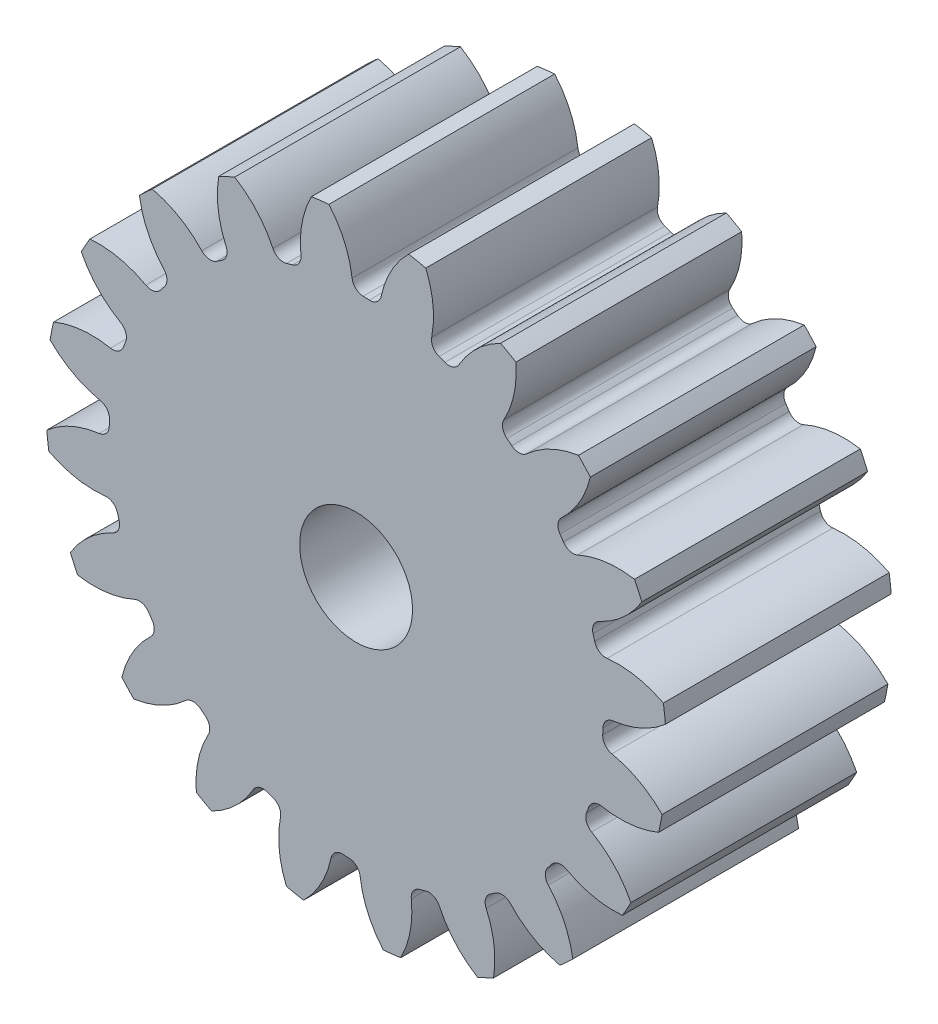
from build123d import *

# Parameters (mm, degrees)
SKETCH3_R         = 139.7
GEARBODY_DEPTH    = 101.6
TOOTHCUT_DEPTH    = 223.159267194
CIRPATTERN1_COUNT = 20
BOREDIA_R         = 25.4
BORE_DEPTH        = 12700


with BuildPart() as part:
    # Sketch3 → gearBody (new body)
    with BuildSketch(Plane.XY):
        Circle(SKETCH3_R)
    extrude(amount=GEARBODY_DEPTH)

    # Sketch2 → toothCut (cut, through all)
    with BuildSketch(Plane.XY):
        with BuildLine():
            ThreePointArc((110.96584488, -5.945325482), (111.031276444, -4.563033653), (111.07948959, -3.180034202))
            ThreePointArc((111.07948959, -3.180034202), (112.425332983, 0.153132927), (115.619083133, 1.802756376))
            ThreePointArc((115.619083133, 1.802756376), (128.494466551, 5.414913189), (139.7, 12.712802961))
            ThreePointArc((139.7, 12.712802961), (140.158933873, -5.760088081), (138.18575314, -24.133026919))
            ThreePointArc((138.18575314, -24.133026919), (127.616835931, -15.940276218), (115.08126673, -11.283809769))
            ThreePointArc((115.08126673, -11.283809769), (112.033646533, -9.377685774), (110.96584488, -5.945325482))
        make_face()
    toothcut = extrude(amount=TOOTHCUT_DEPTH, mode=Mode.SUBTRACT)

    # CirPattern1: toothCut ×20 about axis
    cirpattern1_axis = Axis((0, 0, 0), (0, 0, 1))
    for i in range(1, CIRPATTERN1_COUNT):
        add(toothcut.rotate(cirpattern1_axis, i * 360 / CIRPATTERN1_COUNT), mode=Mode.SUBTRACT)

    # boreDia → bore (cut, symmetric)
    with BuildSketch(Plane.XY):
        Circle(BOREDIA_R)
    extrude(amount=BORE_DEPTH, both=True, mode=Mode.SUBTRACT)


solid = part.part
